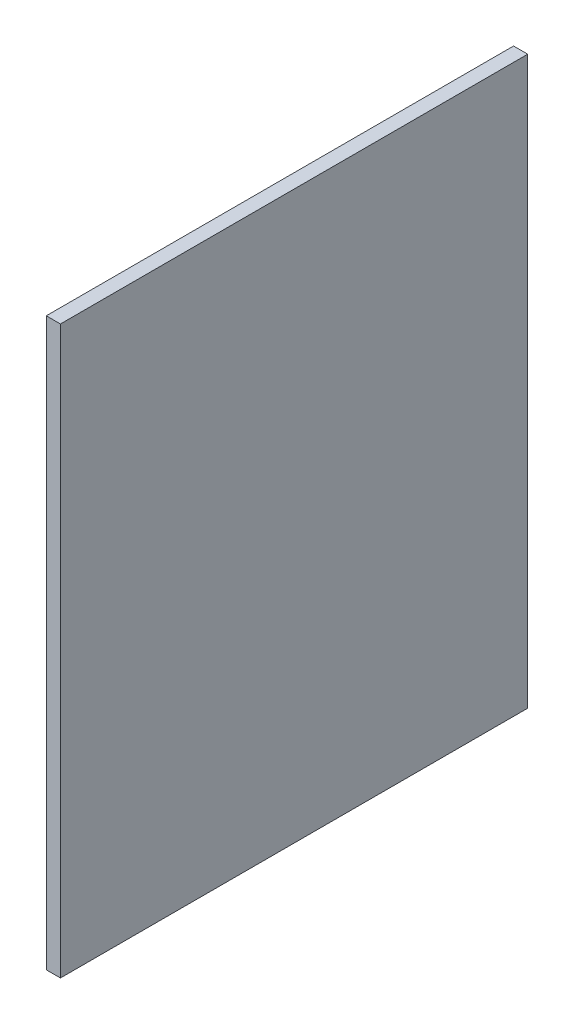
from build123d import *

# Parameters (mm, degrees)
SKETCH1_W      = 419.1
SKETCH1_H      = 508
EXTRUDE1_DEPTH = 12.7


with BuildPart() as part:
    # Sketch1 → Extrude1 (new body)
    with BuildSketch(Plane(origin=(0, 0, 0), x_dir=(0, 0, -1), z_dir=(1, 0, 0))):
        with Locations((-38.1, 0)):
            Rectangle(SKETCH1_W, SKETCH1_H)
    extrude(amount=EXTRUDE1_DEPTH)


solid = part.part
